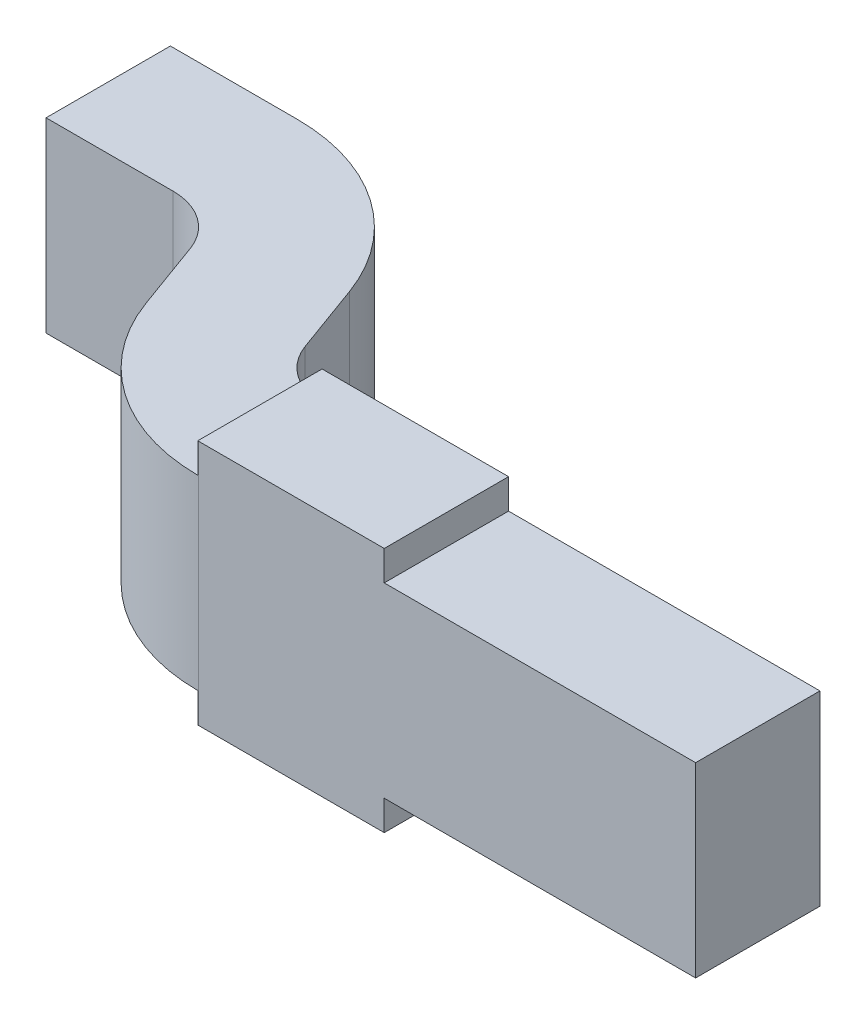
ISO-10303-21;
HEADER;
FILE_DESCRIPTION(('STEP AP214'),'2;1');
FILE_NAME('part.step','',(''),(''),'','','');
FILE_SCHEMA(('AUTOMOTIVE_DESIGN { 1 0 10303 214 1 1 1 1 }'));
ENDSEC;
DATA;
#1=APPLICATION_CONTEXT('core data for automotive mechanical design processes');
#2=APPLICATION_PROTOCOL_DEFINITION('international standard','automotive_design',2000,#1);
#3=PRODUCT_CONTEXT('',#1,'mechanical');
#4=PRODUCT('Part','Part','',(#3));
#5=PRODUCT_RELATED_PRODUCT_CATEGORY('part','',(#4));
#6=PRODUCT_DEFINITION_FORMATION('','',#4);
#7=PRODUCT_DEFINITION_CONTEXT('part definition',#1,'design');
#8=PRODUCT_DEFINITION('design','',#6,#7);
#9=PRODUCT_DEFINITION_SHAPE('','',#8);
#10=(LENGTH_UNIT() NAMED_UNIT(*) SI_UNIT(.MILLI.,.METRE.));
#11=(NAMED_UNIT(*) PLANE_ANGLE_UNIT() SI_UNIT($,.RADIAN.));
#12=(NAMED_UNIT(*) SI_UNIT($,.STERADIAN.) SOLID_ANGLE_UNIT());
#13=UNCERTAINTY_MEASURE_WITH_UNIT(LENGTH_MEASURE(1.E-05),#10,'distance_accuracy_value','');
#14=(GEOMETRIC_REPRESENTATION_CONTEXT(3) GLOBAL_UNCERTAINTY_ASSIGNED_CONTEXT((#13)) GLOBAL_UNIT_ASSIGNED_CONTEXT((#10,
#11,#12)) REPRESENTATION_CONTEXT('',''));
#15=CARTESIAN_POINT('',(0.,0.,0.));
#16=DIRECTION('',(0.,0.,1.));
#17=DIRECTION('',(1.,0.,0.));
#18=AXIS2_PLACEMENT_3D('',#15,#16,#17);
#19=CARTESIAN_POINT('',(-5.79,2.655,0.));
#20=DIRECTION('',(-1.,0.,0.));
#21=DIRECTION('',(0.,0.,1.));
#22=AXIS2_PLACEMENT_3D('',#19,#20,#21);
#23=PLANE('',#22);
#24=DIRECTION('',(0.,1.,0.));
#25=VECTOR('',#24,1.);
#26=CARTESIAN_POINT('',(-5.79,2.655,0.5));
#27=LINE('',#26,#25);
#28=CARTESIAN_POINT('',(-5.79,2.655,0.5));
#29=VERTEX_POINT('',#28);
#30=CARTESIAN_POINT('',(-5.79,1.905,0.5));
#31=VERTEX_POINT('',#30);
#32=EDGE_CURVE('E242',#29,#31,#27,.F.);
#33=ORIENTED_EDGE('',*,*,#32,.F.);
#34=DIRECTION('',(0.,0.,1.));
#35=VECTOR('',#34,1.);
#36=CARTESIAN_POINT('',(-5.79,2.655,0.874745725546));
#37=LINE('',#36,#35);
#38=CARTESIAN_POINT('',(-5.79,2.655,0.));
#39=VERTEX_POINT('',#38);
#40=EDGE_CURVE('E182',#39,#29,#37,.T.);
#41=ORIENTED_EDGE('',*,*,#40,.F.);
#42=DIRECTION('',(0.,1.,0.));
#43=VECTOR('',#42,1.);
#44=CARTESIAN_POINT('',(-5.79,2.655,0.));
#45=LINE('',#44,#43);
#46=CARTESIAN_POINT('',(-5.79,1.905,0.));
#47=VERTEX_POINT('',#46);
#48=EDGE_CURVE('E225',#47,#39,#45,.T.);
#49=ORIENTED_EDGE('',*,*,#48,.F.);
#50=DIRECTION('',(0.,0.,1.));
#51=VECTOR('',#50,1.);
#52=CARTESIAN_POINT('',(-5.79,1.905,0.874745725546));
#53=LINE('',#52,#51);
#54=EDGE_CURVE('E230',#47,#31,#53,.T.);
#55=ORIENTED_EDGE('',*,*,#54,.T.);
#56=EDGE_LOOP('',(#33,#41,#49,#55));
#57=FACE_BOUND('',#56,.T.);
#58=ADVANCED_FACE('F17',(#57),#23,.T.);
#59=CARTESIAN_POINT('',(-5.79,2.655,0.5));
#60=DIRECTION('',(0.,0.,1.));
#61=DIRECTION('',(1.,0.,0.));
#62=AXIS2_PLACEMENT_3D('',#59,#60,#61);
#63=PLANE('',#62);
#64=DIRECTION('',(0.,1.,0.));
#65=VECTOR('',#64,1.);
#66=CARTESIAN_POINT('',(-5.28,2.655,0.5));
#67=LINE('',#66,#65);
#68=CARTESIAN_POINT('',(-5.28,1.905,0.5));
#69=VERTEX_POINT('',#68);
#70=CARTESIAN_POINT('',(-5.28,2.655,0.5));
#71=VERTEX_POINT('',#70);
#72=EDGE_CURVE('E152',#69,#71,#67,.T.);
#73=ORIENTED_EDGE('',*,*,#72,.T.);
#74=DIRECTION('',(1.,0.,0.));
#75=VECTOR('',#74,1.);
#76=CARTESIAN_POINT('',(-4.091426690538,2.655,0.5));
#77=LINE('',#76,#75);
#78=EDGE_CURVE('E181',#29,#71,#77,.T.);
#79=ORIENTED_EDGE('',*,*,#78,.F.);
#80=ORIENTED_EDGE('',*,*,#32,.T.);
#81=DIRECTION('',(1.,0.,0.));
#82=VECTOR('',#81,1.);
#83=CARTESIAN_POINT('',(-4.091426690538,1.905,0.5));
#84=LINE('',#83,#82);
#85=EDGE_CURVE('E232',#31,#69,#84,.T.);
#86=ORIENTED_EDGE('',*,*,#85,.T.);
#87=EDGE_LOOP('',(#73,#79,#80,#86));
#88=FACE_BOUND('',#87,.T.);
#89=ADVANCED_FACE('F546',(#88),#63,.T.);
#90=CARTESIAN_POINT('',(-5.28,2.655,0.75));
#91=DIRECTION('',(0.,1.,0.));
#92=DIRECTION('',(0.,0.,1.));
#93=AXIS2_PLACEMENT_3D('',#90,#91,#92);
#94=CYLINDRICAL_SURFACE('',#93,0.25);
#95=CARTESIAN_POINT('',(-5.28,1.905,0.75));
#96=DIRECTION('',(0.,1.,0.));
#97=DIRECTION('',(0.,0.,1.));
#98=AXIS2_PLACEMENT_3D('',#95,#96,#97);
#99=CIRCLE('',#98,0.25);
#100=CARTESIAN_POINT('',(-5.04507684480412,1.905,0.664494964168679));
#101=VERTEX_POINT('',#100);
#102=EDGE_CURVE('E163',#69,#101,#99,.F.);
#103=ORIENTED_EDGE('',*,*,#102,.T.);
#104=DIRECTION('',(0.,1.,0.));
#105=VECTOR('',#104,1.);
#106=CARTESIAN_POINT('',(-5.045076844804,2.655,0.664494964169));
#107=LINE('',#106,#105);
#108=CARTESIAN_POINT('',(-5.04507684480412,2.655,0.664494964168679));
#109=VERTEX_POINT('',#108);
#110=EDGE_CURVE('E157',#109,#101,#107,.F.);
#111=ORIENTED_EDGE('',*,*,#110,.F.);
#112=CARTESIAN_POINT('',(-5.28,2.655,0.75));
#113=DIRECTION('',(0.,1.,0.));
#114=DIRECTION('',(0.,0.,1.));
#115=AXIS2_PLACEMENT_3D('',#112,#113,#114);
#116=CIRCLE('',#115,0.25);
#117=EDGE_CURVE('E20',#71,#109,#116,.F.);
#118=ORIENTED_EDGE('',*,*,#117,.F.);
#119=ORIENTED_EDGE('',*,*,#72,.F.);
#120=EDGE_LOOP('',(#103,#111,#118,#119));
#121=FACE_BOUND('',#120,.T.);
#122=ADVANCED_FACE('F159',(#121),#94,.F.);
#123=CARTESIAN_POINT('',(-5.045076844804,2.655,0.664494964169));
#124=DIRECTION('',(-0.939692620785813,0.,0.342020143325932));
#125=DIRECTION('',(0.342020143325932,0.,0.939692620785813));
#126=AXIS2_PLACEMENT_3D('',#123,#124,#125);
#127=PLANE('',#126);
#128=DIRECTION('',(0.,1.,0.));
#129=VECTOR('',#128,1.);
#130=CARTESIAN_POINT('',(-4.94247080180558,2.775,0.946402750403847));
#131=LINE('',#130,#129);
#132=CARTESIAN_POINT('',(-4.94247080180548,2.655,0.946402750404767));
#133=VERTEX_POINT('',#132);
#134=CARTESIAN_POINT('',(-4.94247080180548,1.905,0.946402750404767));
#135=VERTEX_POINT('',#134);
#136=EDGE_CURVE('E172',#133,#135,#131,.F.);
#137=ORIENTED_EDGE('',*,*,#136,.F.);
#138=DIRECTION('',(0.342020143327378,0.,0.939692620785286));
#139=VECTOR('',#138,1.);
#140=CARTESIAN_POINT('',(-5.045076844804,2.655,0.664494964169));
#141=LINE('',#140,#139);
#142=EDGE_CURVE('E169',#109,#133,#141,.T.);
#143=ORIENTED_EDGE('',*,*,#142,.F.);
#144=ORIENTED_EDGE('',*,*,#110,.T.);
#145=DIRECTION('',(0.342020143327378,0.,0.939692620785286));
#146=VECTOR('',#145,1.);
#147=CARTESIAN_POINT('',(-5.045076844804,1.905,0.664494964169));
#148=LINE('',#147,#146);
#149=EDGE_CURVE('E260',#101,#135,#148,.T.);
#150=ORIENTED_EDGE('',*,*,#149,.T.);
#151=EDGE_LOOP('',(#137,#143,#144,#150));
#152=FACE_BOUND('',#151,.T.);
#153=ADVANCED_FACE('F170',(#152),#127,.T.);
#154=CARTESIAN_POINT('',(-5.28,2.655,0.75));
#155=DIRECTION('',(0.,1.,0.));
#156=DIRECTION('',(0.,0.,1.));
#157=AXIS2_PLACEMENT_3D('',#154,#155,#156);
#158=CYLINDRICAL_SURFACE('',#157,0.75);
#159=DIRECTION('',(0.,1.,0.));
#160=VECTOR('',#159,1.);
#161=CARTESIAN_POINT('',(-5.28,2.655,0.));
#162=LINE('',#161,#160);
#163=CARTESIAN_POINT('',(-5.28,2.655,0.));
#164=VERTEX_POINT('',#163);
#165=CARTESIAN_POINT('',(-5.28,1.905,0.));
#166=VERTEX_POINT('',#165);
#167=EDGE_CURVE('E166',#164,#166,#162,.F.);
#168=ORIENTED_EDGE('',*,*,#167,.F.);
#169=CARTESIAN_POINT('',(-5.28,2.655,0.75));
#170=DIRECTION('',(0.,1.,0.));
#171=DIRECTION('',(0.,0.,1.));
#172=AXIS2_PLACEMENT_3D('',#169,#170,#171);
#173=CIRCLE('',#172,0.75);
#174=CARTESIAN_POINT('',(-4.57523053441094,2.655,0.493484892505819));
#175=VERTEX_POINT('',#174);
#176=EDGE_CURVE('E262',#175,#164,#173,.T.);
#177=ORIENTED_EDGE('',*,*,#176,.F.);
#178=DIRECTION('',(0.,1.,0.));
#179=VECTOR('',#178,1.);
#180=CARTESIAN_POINT('',(-4.57523053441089,2.655,0.493484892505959));
#181=LINE('',#180,#179);
#182=CARTESIAN_POINT('',(-4.57523053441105,1.905,0.493484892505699));
#183=VERTEX_POINT('',#182);
#184=EDGE_CURVE('E236',#183,#175,#181,.T.);
#185=ORIENTED_EDGE('',*,*,#184,.F.);
#186=CARTESIAN_POINT('',(-5.28,1.905,0.75));
#187=DIRECTION('',(0.,1.,0.));
#188=DIRECTION('',(0.,0.,1.));
#189=AXIS2_PLACEMENT_3D('',#186,#187,#188);
#190=CIRCLE('',#189,0.75);
#191=EDGE_CURVE('E254',#183,#166,#190,.T.);
#192=ORIENTED_EDGE('',*,*,#191,.T.);
#193=EDGE_LOOP('',(#168,#177,#185,#192));
#194=FACE_BOUND('',#193,.T.);
#195=ADVANCED_FACE('F522',(#194),#158,.T.);
#196=CARTESIAN_POINT('',(-5.28,2.655,0.));
#197=DIRECTION('',(0.,0.,-1.));
#198=DIRECTION('',(-1.,0.,0.));
#199=AXIS2_PLACEMENT_3D('',#196,#197,#198);
#200=PLANE('',#199);
#201=ORIENTED_EDGE('',*,*,#48,.T.);
#202=DIRECTION('',(1.,0.,0.));
#203=VECTOR('',#202,1.);
#204=CARTESIAN_POINT('',(-4.091426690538,2.655,0.));
#205=LINE('',#204,#203);
#206=EDGE_CURVE('E239',#164,#39,#205,.F.);
#207=ORIENTED_EDGE('',*,*,#206,.F.);
#208=ORIENTED_EDGE('',*,*,#167,.T.);
#209=DIRECTION('',(1.,0.,0.));
#210=VECTOR('',#209,1.);
#211=CARTESIAN_POINT('',(-4.091426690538,1.905,0.));
#212=LINE('',#211,#210);
#213=EDGE_CURVE('E256',#166,#47,#212,.F.);
#214=ORIENTED_EDGE('',*,*,#213,.T.);
#215=EDGE_LOOP('',(#201,#207,#208,#214));
#216=FACE_BOUND('',#215,.T.);
#217=ADVANCED_FACE('F514',(#216),#200,.T.);
#218=CARTESIAN_POINT('',(-4.237701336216,2.775,0.68988764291));
#219=DIRECTION('',(0.,1.,0.));
#220=DIRECTION('',(0.,0.,1.));
#221=AXIS2_PLACEMENT_3D('',#218,#219,#220);
#222=CYLINDRICAL_SURFACE('',#221,0.75);
#223=DIRECTION('',(1.,0.,0.));
#224=VECTOR('',#223,1.);
#225=CARTESIAN_POINT('',(-4.091426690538,1.785,1.439884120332));
#226=LINE('',#225,#224);
#227=CARTESIAN_POINT('',(-4.24,1.785,1.4398841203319));
#228=VERTEX_POINT('',#227);
#229=CARTESIAN_POINT('',(-4.237701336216,1.785,1.43988764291));
#230=VERTEX_POINT('',#229);
#231=EDGE_CURVE('E319',#228,#230,#226,.T.);
#232=ORIENTED_EDGE('',*,*,#231,.T.);
#233=DIRECTION('',(0.,1.,0.));
#234=VECTOR('',#233,1.);
#235=CARTESIAN_POINT('',(-4.237701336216,2.775,1.43988764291));
#236=LINE('',#235,#234);
#237=CARTESIAN_POINT('',(-4.237701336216,2.775,1.43988764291));
#238=VERTEX_POINT('',#237);
#239=EDGE_CURVE('E209',#238,#230,#236,.F.);
#240=ORIENTED_EDGE('',*,*,#239,.F.);
#241=DIRECTION('',(1.,0.,0.));
#242=VECTOR('',#241,1.);
#243=CARTESIAN_POINT('',(-4.091426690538,2.775,1.439884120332));
#244=LINE('',#243,#242);
#245=CARTESIAN_POINT('',(-4.24,2.775,1.439884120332));
#246=VERTEX_POINT('',#245);
#247=EDGE_CURVE('E205',#246,#238,#244,.T.);
#248=ORIENTED_EDGE('',*,*,#247,.F.);
#249=DIRECTION('',(0.,1.,0.));
#250=VECTOR('',#249,1.);
#251=CARTESIAN_POINT('',(-4.24,-3.25,1.439884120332));
#252=LINE('',#251,#250);
#253=CARTESIAN_POINT('',(-4.24,2.655,1.4398841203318));
#254=VERTEX_POINT('',#253);
#255=EDGE_CURVE('E184',#254,#246,#252,.T.);
#256=ORIENTED_EDGE('',*,*,#255,.F.);
#257=CARTESIAN_POINT('',(-4.237701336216,2.655,0.68988764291));
#258=DIRECTION('',(0.,1.,0.));
#259=DIRECTION('',(0.,0.,1.));
#260=AXIS2_PLACEMENT_3D('',#257,#258,#259);
#261=CIRCLE('',#260,0.75);
#262=EDGE_CURVE('E176',#133,#254,#261,.T.);
#263=ORIENTED_EDGE('',*,*,#262,.F.);
#264=ORIENTED_EDGE('',*,*,#136,.T.);
#265=CARTESIAN_POINT('',(-4.237701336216,1.905,0.68988764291));
#266=DIRECTION('',(0.,1.,0.));
#267=DIRECTION('',(0.,0.,1.));
#268=AXIS2_PLACEMENT_3D('',#265,#266,#267);
#269=CIRCLE('',#268,0.75);
#270=CARTESIAN_POINT('',(-4.24,1.905,1.4398841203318));
#271=VERTEX_POINT('',#270);
#272=EDGE_CURVE('E258',#135,#271,#269,.T.);
#273=ORIENTED_EDGE('',*,*,#272,.T.);
#274=DIRECTION('',(0.,1.,0.));
#275=VECTOR('',#274,1.);
#276=CARTESIAN_POINT('',(-4.24,-3.25,1.439884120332));
#277=LINE('',#276,#275);
#278=EDGE_CURVE('E206',#228,#271,#277,.T.);
#279=ORIENTED_EDGE('',*,*,#278,.F.);
#280=EDGE_LOOP('',(#232,#240,#248,#256,#263,#264,#273,#279));
#281=FACE_BOUND('',#280,.T.);
#282=ADVANCED_FACE('F360',(#281),#222,.T.);
#283=CARTESIAN_POINT('',(-4.237701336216,2.775,1.43988764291));
#284=DIRECTION('',(0.,0.,1.));
#285=DIRECTION('',(1.,0.,0.));
#286=AXIS2_PLACEMENT_3D('',#283,#284,#285);
#287=PLANE('',#286);
#288=DIRECTION('',(1.,0.,0.));
#289=VECTOR('',#288,1.);
#290=CARTESIAN_POINT('',(-4.091426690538,2.655,1.43988764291));
#291=LINE('',#290,#289);
#292=CARTESIAN_POINT('',(-3.49,2.655,1.43988764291));
#293=VERTEX_POINT('',#292);
#294=CARTESIAN_POINT('',(-2.237701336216,2.655,1.43988764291));
#295=VERTEX_POINT('',#294);
#296=EDGE_CURVE('E297',#293,#295,#291,.T.);
#297=ORIENTED_EDGE('',*,*,#296,.F.);
#298=DIRECTION('',(0.,1.,0.));
#299=VECTOR('',#298,1.);
#300=CARTESIAN_POINT('',(-3.49,3.25,1.43988764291));
#301=LINE('',#300,#299);
#302=CARTESIAN_POINT('',(-3.49,2.775,1.43988764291));
#303=VERTEX_POINT('',#302);
#304=EDGE_CURVE('E292',#303,#293,#301,.F.);
#305=ORIENTED_EDGE('',*,*,#304,.F.);
#306=DIRECTION('',(1.,0.,0.));
#307=VECTOR('',#306,1.);
#308=CARTESIAN_POINT('',(-4.091426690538,2.775,1.43988764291));
#309=LINE('',#308,#307);
#310=EDGE_CURVE('E217',#238,#303,#309,.T.);
#311=ORIENTED_EDGE('',*,*,#310,.F.);
#312=ORIENTED_EDGE('',*,*,#239,.T.);
#313=DIRECTION('',(1.,0.,0.));
#314=VECTOR('',#313,1.);
#315=CARTESIAN_POINT('',(-4.091426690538,1.785,1.43988764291));
#316=LINE('',#315,#314);
#317=CARTESIAN_POINT('',(-3.49,1.785,1.43988764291));
#318=VERTEX_POINT('',#317);
#319=EDGE_CURVE('E321',#230,#318,#316,.T.);
#320=ORIENTED_EDGE('',*,*,#319,.T.);
#321=DIRECTION('',(0.,1.,0.));
#322=VECTOR('',#321,1.);
#323=CARTESIAN_POINT('',(-3.49,3.25,1.43988764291));
#324=LINE('',#323,#322);
#325=CARTESIAN_POINT('',(-3.49,1.905,1.43988764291));
#326=VERTEX_POINT('',#325);
#327=EDGE_CURVE('E313',#326,#318,#324,.F.);
#328=ORIENTED_EDGE('',*,*,#327,.F.);
#329=DIRECTION('',(1.,0.,0.));
#330=VECTOR('',#329,1.);
#331=CARTESIAN_POINT('',(-4.091426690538,1.905,1.43988764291));
#332=LINE('',#331,#330);
#333=CARTESIAN_POINT('',(-2.237701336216,1.905,1.43988764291));
#334=VERTEX_POINT('',#333);
#335=EDGE_CURVE('E306',#326,#334,#332,.T.);
#336=ORIENTED_EDGE('',*,*,#335,.T.);
#337=DIRECTION('',(0.,1.,0.));
#338=VECTOR('',#337,1.);
#339=CARTESIAN_POINT('',(-2.237701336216,2.655,1.43988764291));
#340=LINE('',#339,#338);
#341=EDGE_CURVE('E300',#295,#334,#340,.F.);
#342=ORIENTED_EDGE('',*,*,#341,.F.);
#343=EDGE_LOOP('',(#297,#305,#311,#312,#320,#328,#336,#342));
#344=FACE_BOUND('',#343,.T.);
#345=ADVANCED_FACE('F355',(#344),#287,.T.);
#346=CARTESIAN_POINT('',(-4.24,-3.25,0.));
#347=DIRECTION('',(-1.,0.,0.));
#348=DIRECTION('',(0.,0.,1.));
#349=AXIS2_PLACEMENT_3D('',#346,#347,#348);
#350=PLANE('',#349);
#351=DIRECTION('',(0.,0.,1.));
#352=VECTOR('',#351,1.);
#353=CARTESIAN_POINT('',(-4.24,2.655,0.874745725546));
#354=LINE('',#353,#352);
#355=CARTESIAN_POINT('',(-4.24,2.655,0.939877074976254));
#356=VERTEX_POINT('',#355);
#357=EDGE_CURVE('E263',#254,#356,#354,.F.);
#358=ORIENTED_EDGE('',*,*,#357,.F.);
#359=ORIENTED_EDGE('',*,*,#255,.T.);
#360=DIRECTION('',(0.,0.,1.));
#361=VECTOR('',#360,1.);
#362=CARTESIAN_POINT('',(-4.24,2.775,0.874745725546));
#363=LINE('',#362,#361);
#364=CARTESIAN_POINT('',(-4.24,2.775,0.939877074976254));
#365=VERTEX_POINT('',#364);
#366=EDGE_CURVE('E202',#365,#246,#363,.T.);
#367=ORIENTED_EDGE('',*,*,#366,.F.);
#368=DIRECTION('',(0.,1.,0.));
#369=VECTOR('',#368,1.);
#370=CARTESIAN_POINT('',(-4.24,2.775,0.939877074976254));
#371=LINE('',#370,#369);
#372=EDGE_CURVE('E190',#365,#356,#371,.F.);
#373=ORIENTED_EDGE('',*,*,#372,.T.);
#374=EDGE_LOOP('',(#358,#359,#367,#373));
#375=FACE_BOUND('',#374,.T.);
#376=ADVANCED_FACE('F491',(#375),#350,.T.);
#377=CARTESIAN_POINT('',(-4.091426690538,2.655,0.874745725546));
#378=DIRECTION('',(0.,1.,0.));
#379=DIRECTION('',(0.,0.,1.));
#380=AXIS2_PLACEMENT_3D('',#377,#378,#379);
#381=PLANE('',#380);
#382=ORIENTED_EDGE('',*,*,#176,.T.);
#383=ORIENTED_EDGE('',*,*,#206,.T.);
#384=ORIENTED_EDGE('',*,*,#40,.T.);
#385=ORIENTED_EDGE('',*,*,#78,.T.);
#386=ORIENTED_EDGE('',*,*,#117,.T.);
#387=ORIENTED_EDGE('',*,*,#142,.T.);
#388=ORIENTED_EDGE('',*,*,#262,.T.);
#389=ORIENTED_EDGE('',*,*,#357,.T.);
#390=CARTESIAN_POINT('',(-4.237701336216,2.655,0.68988764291));
#391=DIRECTION('',(0.,1.,0.));
#392=DIRECTION('',(0.,0.,1.));
#393=AXIS2_PLACEMENT_3D('',#390,#391,#392);
#394=CIRCLE('',#393,0.25);
#395=CARTESIAN_POINT('',(-4.47262449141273,2.655,0.775392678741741));
#396=VERTEX_POINT('',#395);
#397=EDGE_CURVE('E192',#356,#396,#394,.F.);
#398=ORIENTED_EDGE('',*,*,#397,.T.);
#399=DIRECTION('',(-0.342020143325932,0.,-0.939692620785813));
#400=VECTOR('',#399,1.);
#401=CARTESIAN_POINT('',(-4.472624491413,2.655,0.775392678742));
#402=LINE('',#401,#400);
#403=EDGE_CURVE('E233',#175,#396,#402,.F.);
#404=ORIENTED_EDGE('',*,*,#403,.F.);
#405=EDGE_LOOP('',(#382,#383,#384,#385,#386,#387,#388,#389,#398,#404));
#406=FACE_BOUND('',#405,.T.);
#407=ADVANCED_FACE('F179',(#406),#381,.T.);
#408=CARTESIAN_POINT('',(-4.472624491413,2.655,0.775392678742));
#409=DIRECTION('',(0.939692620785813,0.,-0.342020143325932));
#410=DIRECTION('',(-0.342020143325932,0.,-0.939692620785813));
#411=AXIS2_PLACEMENT_3D('',#408,#409,#410);
#412=PLANE('',#411);
#413=ORIENTED_EDGE('',*,*,#184,.T.);
#414=ORIENTED_EDGE('',*,*,#403,.T.);
#415=DIRECTION('',(0.,1.,0.));
#416=VECTOR('',#415,1.);
#417=CARTESIAN_POINT('',(-4.47262449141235,2.775,0.775392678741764));
#418=LINE('',#417,#416);
#419=CARTESIAN_POINT('',(-4.47262449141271,1.905,0.775392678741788));
#420=VERTEX_POINT('',#419);
#421=EDGE_CURVE('E252',#396,#420,#418,.F.);
#422=ORIENTED_EDGE('',*,*,#421,.T.);
#423=DIRECTION('',(-0.342020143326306,0.,-0.939692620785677));
#424=VECTOR('',#423,1.);
#425=CARTESIAN_POINT('',(-4.472624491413,1.905,0.775392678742));
#426=LINE('',#425,#424);
#427=EDGE_CURVE('E257',#420,#183,#426,.T.);
#428=ORIENTED_EDGE('',*,*,#427,.T.);
#429=EDGE_LOOP('',(#413,#414,#422,#428));
#430=FACE_BOUND('',#429,.T.);
#431=ADVANCED_FACE('F474',(#430),#412,.T.);
#432=CARTESIAN_POINT('',(-4.091426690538,1.905,0.874745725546));
#433=DIRECTION('',(0.,1.,0.));
#434=DIRECTION('',(0.,0.,1.));
#435=AXIS2_PLACEMENT_3D('',#432,#433,#434);
#436=PLANE('',#435);
#437=ORIENTED_EDGE('',*,*,#191,.F.);
#438=ORIENTED_EDGE('',*,*,#427,.F.);
#439=CARTESIAN_POINT('',(-4.237701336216,1.905,0.68988764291));
#440=DIRECTION('',(0.,1.,0.));
#441=DIRECTION('',(0.,0.,1.));
#442=AXIS2_PLACEMENT_3D('',#439,#440,#441);
#443=CIRCLE('',#442,0.25);
#444=CARTESIAN_POINT('',(-4.24,1.905,0.939877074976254));
#445=VERTEX_POINT('',#444);
#446=EDGE_CURVE('E249',#420,#445,#443,.T.);
#447=ORIENTED_EDGE('',*,*,#446,.T.);
#448=DIRECTION('',(0.,0.,1.));
#449=VECTOR('',#448,1.);
#450=CARTESIAN_POINT('',(-4.24,1.905,0.));
#451=LINE('',#450,#449);
#452=EDGE_CURVE('E222',#271,#445,#451,.F.);
#453=ORIENTED_EDGE('',*,*,#452,.F.);
#454=ORIENTED_EDGE('',*,*,#272,.F.);
#455=ORIENTED_EDGE('',*,*,#149,.F.);
#456=ORIENTED_EDGE('',*,*,#102,.F.);
#457=ORIENTED_EDGE('',*,*,#85,.F.);
#458=ORIENTED_EDGE('',*,*,#54,.F.);
#459=ORIENTED_EDGE('',*,*,#213,.F.);
#460=EDGE_LOOP('',(#437,#438,#447,#453,#454,#455,#456,#457,#458,#459));
#461=FACE_BOUND('',#460,.T.);
#462=ADVANCED_FACE('F466',(#461),#436,.F.);
#463=CARTESIAN_POINT('',(-4.24,-3.25,0.));
#464=DIRECTION('',(-1.,0.,0.));
#465=DIRECTION('',(0.,0.,1.));
#466=AXIS2_PLACEMENT_3D('',#463,#464,#465);
#467=PLANE('',#466);
#468=DIRECTION('',(0.,0.,1.));
#469=VECTOR('',#468,1.);
#470=CARTESIAN_POINT('',(-4.24,1.785,0.874745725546));
#471=LINE('',#470,#469);
#472=CARTESIAN_POINT('',(-4.24,1.785,0.939877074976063));
#473=VERTEX_POINT('',#472);
#474=EDGE_CURVE('E316',#473,#228,#471,.T.);
#475=ORIENTED_EDGE('',*,*,#474,.T.);
#476=ORIENTED_EDGE('',*,*,#278,.T.);
#477=ORIENTED_EDGE('',*,*,#452,.T.);
#478=DIRECTION('',(0.,1.,0.));
#479=VECTOR('',#478,1.);
#480=CARTESIAN_POINT('',(-4.24,2.775,0.939877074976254));
#481=LINE('',#480,#479);
#482=EDGE_CURVE('E251',#445,#473,#481,.F.);
#483=ORIENTED_EDGE('',*,*,#482,.T.);
#484=EDGE_LOOP('',(#475,#476,#477,#483));
#485=FACE_BOUND('',#484,.T.);
#486=ADVANCED_FACE('F458',(#485),#467,.T.);
#487=CARTESIAN_POINT('',(-4.091426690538,2.775,0.874745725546));
#488=DIRECTION('',(0.,1.,0.));
#489=DIRECTION('',(0.,0.,1.));
#490=AXIS2_PLACEMENT_3D('',#487,#488,#489);
#491=PLANE('',#490);
#492=DIRECTION('',(0.,0.,-1.));
#493=VECTOR('',#492,1.);
#494=CARTESIAN_POINT('',(-3.49,2.775,0.));
#495=LINE('',#494,#493);
#496=CARTESIAN_POINT('',(-3.49,2.775,0.93988764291));
#497=VERTEX_POINT('',#496);
#498=EDGE_CURVE('E289',#497,#303,#495,.F.);
#499=ORIENTED_EDGE('',*,*,#498,.F.);
#500=DIRECTION('',(-1.,0.,0.));
#501=VECTOR('',#500,1.);
#502=CARTESIAN_POINT('',(-2.237701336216,2.775,0.93988764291));
#503=LINE('',#502,#501);
#504=CARTESIAN_POINT('',(-4.237701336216,2.775,0.93988764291));
#505=VERTEX_POINT('',#504);
#506=EDGE_CURVE('E199',#505,#497,#503,.F.);
#507=ORIENTED_EDGE('',*,*,#506,.F.);
#508=CARTESIAN_POINT('',(-4.237701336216,2.775,0.68988764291));
#509=DIRECTION('',(0.,1.,0.));
#510=DIRECTION('',(0.,0.,1.));
#511=AXIS2_PLACEMENT_3D('',#508,#509,#510);
#512=CIRCLE('',#511,0.25);
#513=EDGE_CURVE('E196',#505,#365,#512,.F.);
#514=ORIENTED_EDGE('',*,*,#513,.T.);
#515=ORIENTED_EDGE('',*,*,#366,.T.);
#516=ORIENTED_EDGE('',*,*,#247,.T.);
#517=ORIENTED_EDGE('',*,*,#310,.T.);
#518=EDGE_LOOP('',(#499,#507,#514,#515,#516,#517));
#519=FACE_BOUND('',#518,.T.);
#520=ADVANCED_FACE('F369',(#519),#491,.T.);
#521=CARTESIAN_POINT('',(-3.49,3.25,0.));
#522=DIRECTION('',(1.,0.,0.));
#523=DIRECTION('',(0.,0.,-1.));
#524=AXIS2_PLACEMENT_3D('',#521,#522,#523);
#525=PLANE('',#524);
#526=DIRECTION('',(0.,0.,1.));
#527=VECTOR('',#526,1.);
#528=CARTESIAN_POINT('',(-3.49,2.655,0.874745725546));
#529=LINE('',#528,#527);
#530=CARTESIAN_POINT('',(-3.49,2.655,0.93988764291));
#531=VERTEX_POINT('',#530);
#532=EDGE_CURVE('E294',#531,#293,#529,.T.);
#533=ORIENTED_EDGE('',*,*,#532,.F.);
#534=DIRECTION('',(0.,1.,0.));
#535=VECTOR('',#534,1.);
#536=CARTESIAN_POINT('',(-3.49,2.775,0.93988764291));
#537=LINE('',#536,#535);
#538=EDGE_CURVE('E327',#497,#531,#537,.F.);
#539=ORIENTED_EDGE('',*,*,#538,.F.);
#540=ORIENTED_EDGE('',*,*,#498,.T.);
#541=ORIENTED_EDGE('',*,*,#304,.T.);
#542=EDGE_LOOP('',(#533,#539,#540,#541));
#543=FACE_BOUND('',#542,.T.);
#544=ADVANCED_FACE('F373',(#543),#525,.T.);
#545=CARTESIAN_POINT('',(-4.091426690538,2.655,0.874745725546));
#546=DIRECTION('',(0.,1.,0.));
#547=DIRECTION('',(0.,0.,1.));
#548=AXIS2_PLACEMENT_3D('',#545,#546,#547);
#549=PLANE('',#548);
#550=DIRECTION('',(0.,0.,-1.));
#551=VECTOR('',#550,1.);
#552=CARTESIAN_POINT('',(-2.237701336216,2.655,1.43988764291));
#553=LINE('',#552,#551);
#554=CARTESIAN_POINT('',(-2.237701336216,2.655,0.93988764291));
#555=VERTEX_POINT('',#554);
#556=EDGE_CURVE('E303',#555,#295,#553,.F.);
#557=ORIENTED_EDGE('',*,*,#556,.F.);
#558=DIRECTION('',(-1.,0.,0.));
#559=VECTOR('',#558,1.);
#560=CARTESIAN_POINT('',(-2.237701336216,2.655,0.93988764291));
#561=LINE('',#560,#559);
#562=EDGE_CURVE('E330',#531,#555,#561,.F.);
#563=ORIENTED_EDGE('',*,*,#562,.F.);
#564=ORIENTED_EDGE('',*,*,#532,.T.);
#565=ORIENTED_EDGE('',*,*,#296,.T.);
#566=EDGE_LOOP('',(#557,#563,#564,#565));
#567=FACE_BOUND('',#566,.T.);
#568=ADVANCED_FACE('F375',(#567),#549,.T.);
#569=CARTESIAN_POINT('',(-2.237701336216,2.655,1.43988764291));
#570=DIRECTION('',(1.,0.,0.));
#571=DIRECTION('',(0.,0.,-1.));
#572=AXIS2_PLACEMENT_3D('',#569,#570,#571);
#573=PLANE('',#572);
#574=DIRECTION('',(0.,1.,0.));
#575=VECTOR('',#574,1.);
#576=CARTESIAN_POINT('',(-2.237701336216,2.775,0.93988764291));
#577=LINE('',#576,#575);
#578=CARTESIAN_POINT('',(-2.237701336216,1.905,0.93988764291));
#579=VERTEX_POINT('',#578);
#580=EDGE_CURVE('E333',#555,#579,#577,.F.);
#581=ORIENTED_EDGE('',*,*,#580,.F.);
#582=ORIENTED_EDGE('',*,*,#556,.T.);
#583=ORIENTED_EDGE('',*,*,#341,.T.);
#584=DIRECTION('',(0.,0.,1.));
#585=VECTOR('',#584,1.);
#586=CARTESIAN_POINT('',(-2.237701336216,1.905,0.874745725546));
#587=LINE('',#586,#585);
#588=EDGE_CURVE('E308',#334,#579,#587,.F.);
#589=ORIENTED_EDGE('',*,*,#588,.T.);
#590=EDGE_LOOP('',(#581,#582,#583,#589));
#591=FACE_BOUND('',#590,.T.);
#592=ADVANCED_FACE('F378',(#591),#573,.T.);
#593=CARTESIAN_POINT('',(-4.091426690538,1.905,0.874745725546));
#594=DIRECTION('',(0.,1.,0.));
#595=DIRECTION('',(0.,0.,1.));
#596=AXIS2_PLACEMENT_3D('',#593,#594,#595);
#597=PLANE('',#596);
#598=ORIENTED_EDGE('',*,*,#588,.F.);
#599=ORIENTED_EDGE('',*,*,#335,.F.);
#600=DIRECTION('',(0.,0.,-1.));
#601=VECTOR('',#600,1.);
#602=CARTESIAN_POINT('',(-3.49,1.905,0.));
#603=LINE('',#602,#601);
#604=CARTESIAN_POINT('',(-3.49,1.905,0.93988764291));
#605=VERTEX_POINT('',#604);
#606=EDGE_CURVE('E310',#605,#326,#603,.F.);
#607=ORIENTED_EDGE('',*,*,#606,.F.);
#608=DIRECTION('',(-1.,0.,0.));
#609=VECTOR('',#608,1.);
#610=CARTESIAN_POINT('',(-2.237701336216,1.905,0.93988764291));
#611=LINE('',#610,#609);
#612=EDGE_CURVE('E336',#579,#605,#611,.T.);
#613=ORIENTED_EDGE('',*,*,#612,.F.);
#614=EDGE_LOOP('',(#598,#599,#607,#613));
#615=FACE_BOUND('',#614,.T.);
#616=ADVANCED_FACE('F382',(#615),#597,.F.);
#617=CARTESIAN_POINT('',(-3.49,3.25,0.));
#618=DIRECTION('',(1.,0.,0.));
#619=DIRECTION('',(0.,0.,-1.));
#620=AXIS2_PLACEMENT_3D('',#617,#618,#619);
#621=PLANE('',#620);
#622=DIRECTION('',(0.,0.,1.));
#623=VECTOR('',#622,1.);
#624=CARTESIAN_POINT('',(-3.49,1.785,0.874745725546));
#625=LINE('',#624,#623);
#626=CARTESIAN_POINT('',(-3.49,1.785,0.93988764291));
#627=VERTEX_POINT('',#626);
#628=EDGE_CURVE('E193',#318,#627,#625,.F.);
#629=ORIENTED_EDGE('',*,*,#628,.T.);
#630=DIRECTION('',(0.,1.,0.));
#631=VECTOR('',#630,1.);
#632=CARTESIAN_POINT('',(-3.49,2.775,0.93988764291));
#633=LINE('',#632,#631);
#634=EDGE_CURVE('E339',#605,#627,#633,.F.);
#635=ORIENTED_EDGE('',*,*,#634,.F.);
#636=ORIENTED_EDGE('',*,*,#606,.T.);
#637=ORIENTED_EDGE('',*,*,#327,.T.);
#638=EDGE_LOOP('',(#629,#635,#636,#637));
#639=FACE_BOUND('',#638,.T.);
#640=ADVANCED_FACE('F351',(#639),#621,.T.);
#641=CARTESIAN_POINT('',(-4.091426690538,1.785,0.874745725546));
#642=DIRECTION('',(0.,1.,0.));
#643=DIRECTION('',(0.,0.,1.));
#644=AXIS2_PLACEMENT_3D('',#641,#642,#643);
#645=PLANE('',#644);
#646=ORIENTED_EDGE('',*,*,#628,.F.);
#647=ORIENTED_EDGE('',*,*,#319,.F.);
#648=ORIENTED_EDGE('',*,*,#231,.F.);
#649=ORIENTED_EDGE('',*,*,#474,.F.);
#650=CARTESIAN_POINT('',(-4.237701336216,1.785,0.68988764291));
#651=DIRECTION('',(0.,1.,0.));
#652=DIRECTION('',(0.,0.,1.));
#653=AXIS2_PLACEMENT_3D('',#650,#651,#652);
#654=CIRCLE('',#653,0.25);
#655=CARTESIAN_POINT('',(-4.237701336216,1.785,0.93988764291));
#656=VERTEX_POINT('',#655);
#657=EDGE_CURVE('E35',#473,#656,#654,.T.);
#658=ORIENTED_EDGE('',*,*,#657,.T.);
#659=DIRECTION('',(-1.,0.,0.));
#660=VECTOR('',#659,1.);
#661=CARTESIAN_POINT('',(-2.237701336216,1.785,0.93988764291));
#662=LINE('',#661,#660);
#663=EDGE_CURVE('E26',#627,#656,#662,.T.);
#664=ORIENTED_EDGE('',*,*,#663,.F.);
#665=EDGE_LOOP('',(#646,#647,#648,#649,#658,#664));
#666=FACE_BOUND('',#665,.T.);
#667=ADVANCED_FACE('F347',(#666),#645,.F.);
#668=CARTESIAN_POINT('',(-4.237701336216,2.775,0.68988764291));
#669=DIRECTION('',(0.,1.,0.));
#670=DIRECTION('',(0.,0.,1.));
#671=AXIS2_PLACEMENT_3D('',#668,#669,#670);
#672=CYLINDRICAL_SURFACE('',#671,0.25);
#673=DIRECTION('',(0.,1.,0.));
#674=VECTOR('',#673,1.);
#675=CARTESIAN_POINT('',(-4.237701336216,2.775,0.93988764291));
#676=LINE('',#675,#674);
#677=EDGE_CURVE('E11',#656,#505,#676,.T.);
#678=ORIENTED_EDGE('',*,*,#677,.F.);
#679=ORIENTED_EDGE('',*,*,#657,.F.);
#680=ORIENTED_EDGE('',*,*,#482,.F.);
#681=ORIENTED_EDGE('',*,*,#446,.F.);
#682=ORIENTED_EDGE('',*,*,#421,.F.);
#683=ORIENTED_EDGE('',*,*,#397,.F.);
#684=ORIENTED_EDGE('',*,*,#372,.F.);
#685=ORIENTED_EDGE('',*,*,#513,.F.);
#686=EDGE_LOOP('',(#678,#679,#680,#681,#682,#683,#684,#685));
#687=FACE_BOUND('',#686,.T.);
#688=ADVANCED_FACE('F364',(#687),#672,.F.);
#689=CARTESIAN_POINT('',(-2.237701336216,2.775,0.93988764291));
#690=DIRECTION('',(0.,0.,-1.));
#691=DIRECTION('',(-1.,0.,0.));
#692=AXIS2_PLACEMENT_3D('',#689,#690,#691);
#693=PLANE('',#692);
#694=ORIENTED_EDGE('',*,*,#663,.T.);
#695=ORIENTED_EDGE('',*,*,#677,.T.);
#696=ORIENTED_EDGE('',*,*,#506,.T.);
#697=ORIENTED_EDGE('',*,*,#538,.T.);
#698=ORIENTED_EDGE('',*,*,#562,.T.);
#699=ORIENTED_EDGE('',*,*,#580,.T.);
#700=ORIENTED_EDGE('',*,*,#612,.T.);
#701=ORIENTED_EDGE('',*,*,#634,.T.);
#702=EDGE_LOOP('',(#694,#695,#696,#697,#698,#699,#700,#701));
#703=FACE_BOUND('',#702,.T.);
#704=ADVANCED_FACE('F344',(#703),#693,.T.);
#705=CLOSED_SHELL('',(#58,#89,#122,#153,#195,#217,#282,#345,#376,#407,#431,#462,#486,#520,#544,
#568,#592,#616,#640,#667,#688,#704));
#706=MANIFOLD_SOLID_BREP('B1',#705);
#707=ADVANCED_BREP_SHAPE_REPRESENTATION('',(#18,#706),#14);
#708=SHAPE_DEFINITION_REPRESENTATION(#9,#707);
ENDSEC;
END-ISO-10303-21;
